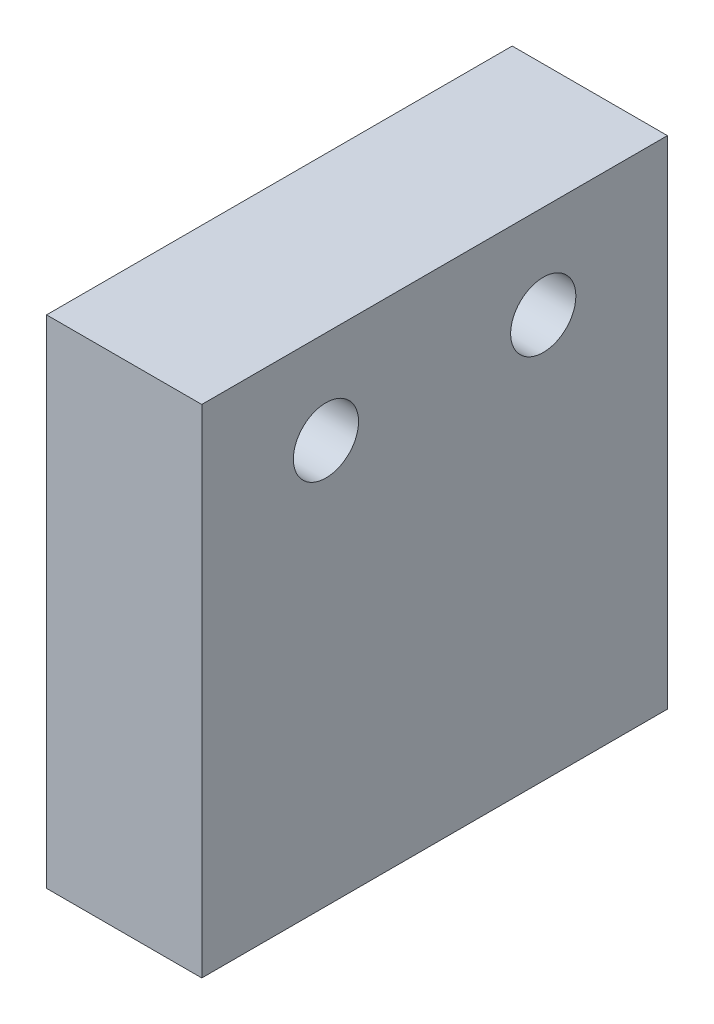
from build123d import *

# Parameters (mm, degrees)
SKETCH_1_W          = 10
SKETCH_1_H          = 32
EXTRUDE_1_DEPTH     = 30
SKETCH_2_R          = 2.1
CUT_EXTRUDE_1_DEPTH = 30
SKETCH_4_R          = 2.5
CUT_EXTRUDE_2_DEPTH = 12


with BuildPart() as part:
    # Sketch 1 → Extrude 1 (new body)
    with BuildSketch(Plane.XY):
        with Locations((5, 16)):
            Rectangle(SKETCH_1_W, SKETCH_1_H)
    extrude(amount=EXTRUDE_1_DEPTH)

    # Sketch 2 → Cut-Extrude 1 (cut)
    with BuildSketch(Plane(origin=(10, 0, 0), x_dir=(0, 0, -1), z_dir=(1, 0, 0))):
        with Locations((-22, 26)):
            Circle(SKETCH_2_R)
        with Locations((-8, 26)):
            Circle(SKETCH_2_R)
    extrude(amount=-CUT_EXTRUDE_1_DEPTH, mode=Mode.SUBTRACT)

    # Sketch 4 → Cut-Extrude 2 (cut)
    with BuildSketch(Plane.XZ):
        with Locations(Location((5, 25, 0), (0, 0, 270))):
            Circle(SKETCH_4_R)
        with Locations(Location((5, 5, 0), (0, 0, 270))):
            Circle(SKETCH_4_R)
    extrude(amount=-CUT_EXTRUDE_2_DEPTH, mode=Mode.SUBTRACT)


solid = part.part
